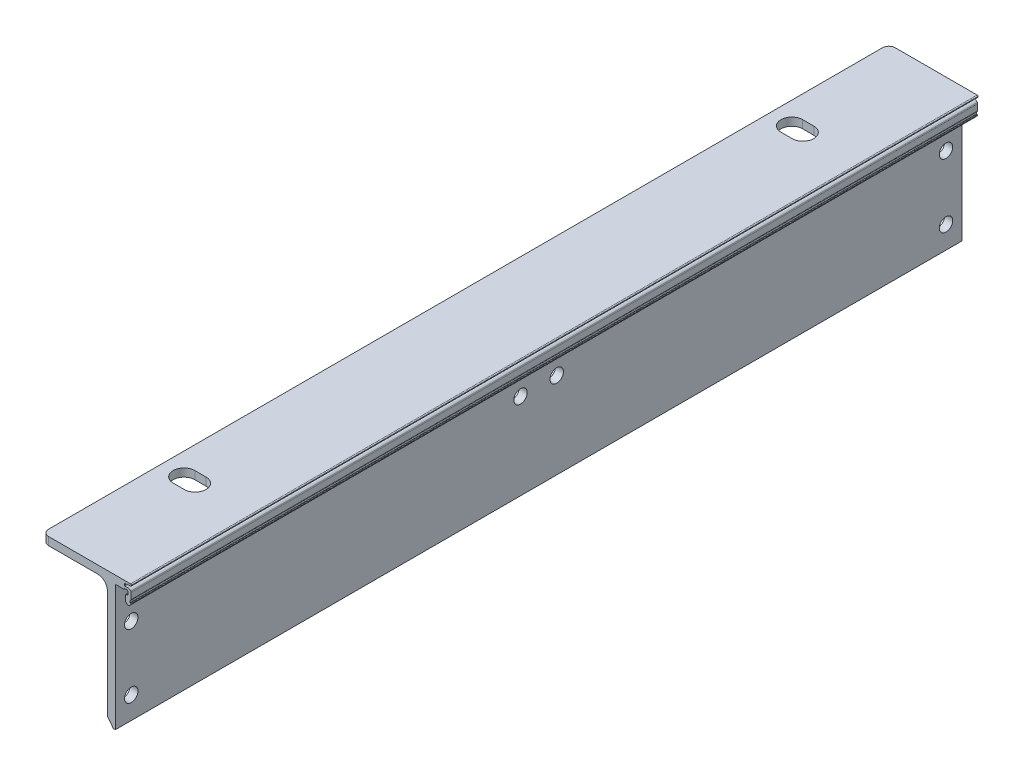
from build123d import *

# Parameters (mm, degrees)
EXTRUDE_1_DEPTH     = 132.675
FILLET_2_R          = 3
CUT_EXTRUDE_1_DEPTH = 2363.027182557
SKETCH_3_R          = 2.1
CUT_EXTRUDE_2_DEPTH = 3335.806493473
FILLET_1_R          = 2


with BuildPart() as part:
    # Sketch 1 → Extrude 1 (new, symmetric)
    with BuildSketch(Plane.XY):
        with BuildLine():
            Line((2329.984035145, -3290.103769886), (2355.384035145, -3290.103769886))
            Line((2355.384035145, -3290.103769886), (2357.624035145, -3290.103769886))
            ThreePointArc((2357.624035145, -3290.103769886), (2357.836167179, -3290.191637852), (2357.924035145, -3290.403769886))
            Line((2357.924035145, -3290.403769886), (2357.924035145, -3290.492459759))
            ThreePointArc((2357.924035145, -3290.492459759), (2357.87266411, -3290.626285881), (2357.744940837, -3290.691364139))
            Line((2357.744940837, -3290.691364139), (2355.903129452, -3290.884946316))
            ThreePointArc((2355.903129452, -3290.884946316), (2355.775406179, -3290.950024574), (2355.724035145, -3291.083850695))
            Line((2355.724035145, -3291.083850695), (2355.724035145, -3291.403769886))
            ThreePointArc((2355.724035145, -3291.403769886), (2355.782613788, -3291.545191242), (2355.924035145, -3291.603769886))
            Line((2355.924035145, -3291.603769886), (2356.769984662, -3291.603769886))
            ThreePointArc((2356.769984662, -3291.603769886), (2357.299096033, -3291.726717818), (2357.719785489, -3292.070367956))
            ThreePointArc((2357.719785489, -3292.070367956), (2357.797255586, -3292.214513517), (2357.824035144, -3292.375952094))
            Line((2357.824035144, -3292.375952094), (2357.824035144, -3294.273769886))
            ThreePointArc((2357.824035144, -3294.273769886), (2357.779946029, -3294.430325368), (2357.660637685, -3294.540864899))
            ThreePointArc((2357.660637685, -3294.540864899), (2357.54132934, -3294.65140443), (2357.497240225, -3294.807959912))
            Line((2357.497240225, -3294.807959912), (2357.497240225, -3295.307959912))
            ThreePointArc((2357.497240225, -3295.307959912), (2357.526529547, -3295.37867059), (2357.597240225, -3295.407959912))
            Line((2357.597240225, -3295.407959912), (2357.724035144, -3295.407959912))
            ThreePointArc((2357.724035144, -3295.407959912), (2357.794745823, -3295.437249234), (2357.824035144, -3295.507959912))
            Line((2357.824035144, -3295.507959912), (2357.824035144, -3295.527361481))
            ThreePointArc((2357.824035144, -3295.527361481), (2357.818000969, -3295.561572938), (2357.800626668, -3295.591655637))
            Line((2357.800626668, -3295.591655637), (2357.383057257, -3296.089092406))
            ThreePointArc((2357.383057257, -3296.089092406), (2356.924035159, -3296.303081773), (2356.465013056, -3296.089092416))
            Line((2356.465013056, -3296.089092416), (2356.094260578, -3295.647427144))
            ThreePointArc((2356.094260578, -3295.647427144), (2356.042137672, -3295.557179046), (2356.024035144, -3295.454544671))
            Line((2356.024035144, -3295.454544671), (2356.024035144, -3294.003769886))
            ThreePointArc((2356.024035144, -3294.003769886), (2356.11190311, -3293.791637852), (2356.324035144, -3293.703769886))
            Line((2356.324035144, -3293.703769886), (2356.524035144, -3293.703769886))
            ThreePointArc((2356.524035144, -3293.703769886), (2356.736167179, -3293.61590192), (2356.824035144, -3293.403769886))
            Line((2356.824035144, -3293.403769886), (2356.824035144, -3292.603769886))
            ThreePointArc((2356.824035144, -3292.603769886), (2356.736167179, -3292.391637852), (2356.524035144, -3292.303769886))
            Line((2356.524035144, -3292.303769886), (2355.987964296, -3292.303769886))
            ThreePointArc((2355.987964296, -3292.303769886), (2355.837964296, -3292.343962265), (2355.728156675, -3292.453769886))
            ThreePointArc((2355.728156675, -3292.453769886), (2355.618349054, -3292.563577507), (2355.468349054, -3292.603769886))
            Line((2355.468349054, -3292.603769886), (2355.384035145, -3292.603769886))
            Line((2355.384035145, -3292.603769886), (2352.884035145, -3292.603769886))
            Line((2352.884035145, -3292.603769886), (2352.884035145, -3332.103769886))
            Line((2352.884035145, -3332.103769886), (2352.284035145, -3332.103769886))
            Line((2352.284035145, -3332.103769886), (2350.384035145, -3329.603769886))
            Line((2350.384035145, -3329.603769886), (2350.384035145, -3292.603769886))
            Line((2350.384035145, -3292.603769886), (2329.984035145, -3292.603769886))
            Line((2329.984035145, -3292.603769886), (2329.984035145, -3290.103769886))
        make_face()
    extrude(amount=EXTRUDE_1_DEPTH, both=True)

    # Fillet 2
    fillet_2_edges = [part.edges().sort_by_distance(p)[0] for p in [
        (2350.384035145, -3292.603769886, 0),
    ]]
    fillet(fillet_2_edges, radius=FILLET_2_R)

    # Sketch 2 → Cut-Extrude 1 (cut, through all)
    with BuildSketch(Plane(origin=(0, -3290.103769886, 0), x_dir=(1, 0, 0), z_dir=(0, 1, 0))):
        with BuildLine():
            Line((2340.484035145, -91.85), (2336.984035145, -91.85))
            ThreePointArc((2336.984035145, -91.85), (2333.584035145, -95.25), (2336.984035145, -98.65))
            Line((2336.984035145, -98.65), (2340.484035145, -98.65))
            ThreePointArc((2340.484035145, -98.65), (2343.884035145, -95.25), (2340.484035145, -91.85))
        make_face()
        with BuildLine():
            Line((2340.484035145, 98.65), (2336.984035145, 98.65))
            ThreePointArc((2336.984035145, 98.65), (2333.584035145, 95.25), (2336.984035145, 91.85))
            Line((2336.984035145, 91.85), (2340.484035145, 91.85))
            ThreePointArc((2340.484035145, 91.85), (2343.884035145, 95.25), (2340.484035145, 98.65))
        make_face()
    extrude(amount=-CUT_EXTRUDE_1_DEPTH, mode=Mode.SUBTRACT)

    # Sketch 3 → Cut-Extrude 2 (cut, through all)
    with BuildSketch(Plane.ZY.offset(-2350.384035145)):
        with Locations(Location((-127.675, -3305.103769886, 0), (0, 0, 270))):
            Circle(SKETCH_3_R)
        with Locations(Location((-127.675, -3325.103769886, 0), (0, 0, 270))):
            Circle(SKETCH_3_R)
        with Locations(Location((5.675, -3305.103769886, 0), (0, 0, 270))):
            Circle(SKETCH_3_R)
        with Locations(Location((-5.675, -3305.103769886, 0), (0, 0, 270))):
            Circle(SKETCH_3_R)
        with Locations((127.675, -3305.103769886)):
            Circle(SKETCH_3_R)
        with Locations((127.675, -3325.103769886)):
            Circle(SKETCH_3_R)
    extrude(amount=-CUT_EXTRUDE_2_DEPTH, mode=Mode.SUBTRACT)

    # Fillet 1
    fillet_1_edges = [part.edges().sort_by_distance(p)[0] for p in [
        (2329.984035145, -3291.353769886, 132.675),
        (2329.984035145, -3291.353769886, -132.675),
    ]]
    fillet(fillet_1_edges, radius=FILLET_1_R)


solid = part.part
